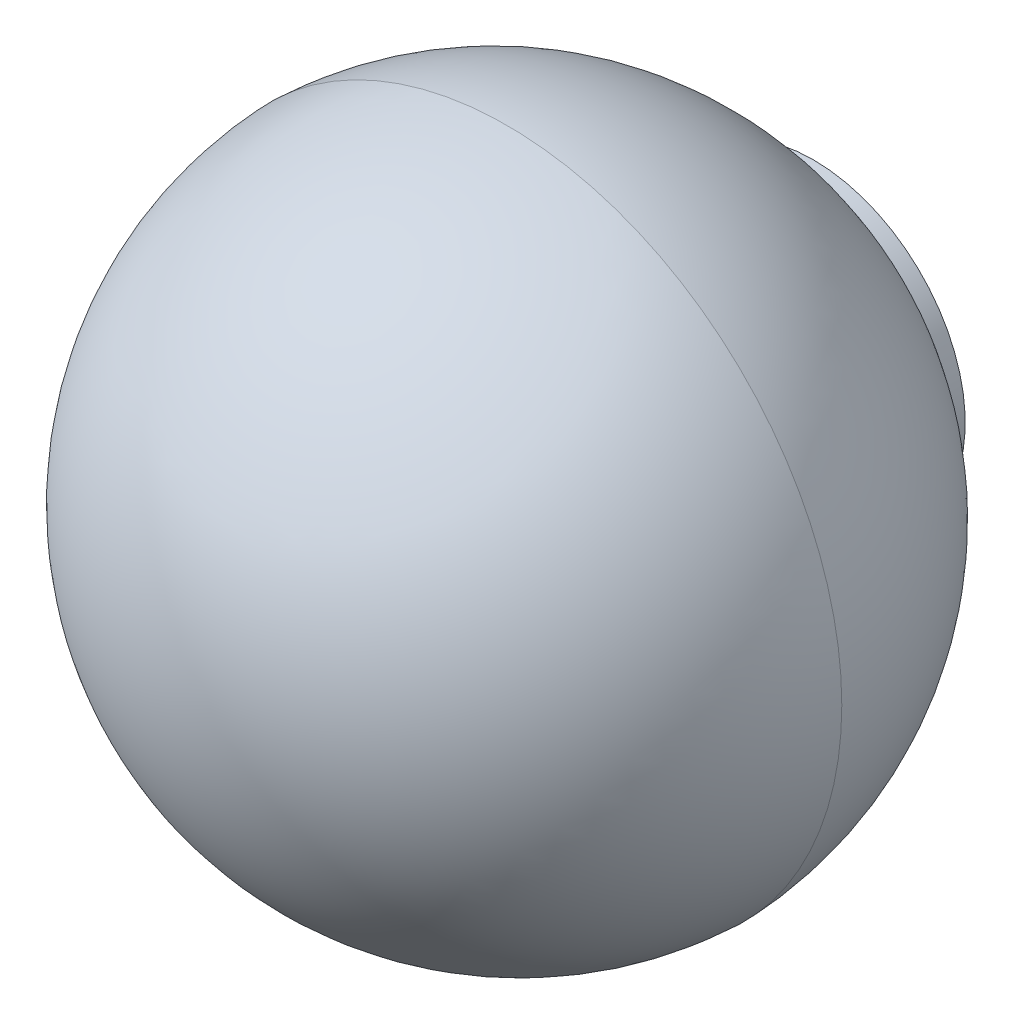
ISO-10303-21;
HEADER;
FILE_DESCRIPTION(('STEP AP214'),'2;1');
FILE_NAME('part.step','',(''),(''),'','','');
FILE_SCHEMA(('AUTOMOTIVE_DESIGN { 1 0 10303 214 1 1 1 1 }'));
ENDSEC;
DATA;
#1=APPLICATION_CONTEXT('core data for automotive mechanical design processes');
#2=APPLICATION_PROTOCOL_DEFINITION('international standard','automotive_design',2000,#1);
#3=PRODUCT_CONTEXT('',#1,'mechanical');
#4=PRODUCT('Part','Part','',(#3));
#5=PRODUCT_RELATED_PRODUCT_CATEGORY('part','',(#4));
#6=PRODUCT_DEFINITION_FORMATION('','',#4);
#7=PRODUCT_DEFINITION_CONTEXT('part definition',#1,'design');
#8=PRODUCT_DEFINITION('design','',#6,#7);
#9=PRODUCT_DEFINITION_SHAPE('','',#8);
#10=(LENGTH_UNIT() NAMED_UNIT(*) SI_UNIT(.MILLI.,.METRE.));
#11=(NAMED_UNIT(*) PLANE_ANGLE_UNIT() SI_UNIT($,.RADIAN.));
#12=(NAMED_UNIT(*) SI_UNIT($,.STERADIAN.) SOLID_ANGLE_UNIT());
#13=UNCERTAINTY_MEASURE_WITH_UNIT(LENGTH_MEASURE(1.E-05),#10,'distance_accuracy_value','');
#14=(GEOMETRIC_REPRESENTATION_CONTEXT(3) GLOBAL_UNCERTAINTY_ASSIGNED_CONTEXT((#13)) GLOBAL_UNIT_ASSIGNED_CONTEXT((#10,
#11,#12)) REPRESENTATION_CONTEXT('',''));
#15=CARTESIAN_POINT('',(0.,0.,0.));
#16=DIRECTION('',(0.,0.,1.));
#17=DIRECTION('',(1.,0.,0.));
#18=AXIS2_PLACEMENT_3D('',#15,#16,#17);
#19=CARTESIAN_POINT('',(0.,0.,14.));
#20=DIRECTION('',(0.,0.,-1.));
#21=DIRECTION('',(-1.,0.,0.));
#22=AXIS2_PLACEMENT_3D('',#19,#20,#21);
#23=SPHERICAL_SURFACE('',#22,16.);
#24=CARTESIAN_POINT('',(0.,0.,14.631575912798));
#25=DIRECTION('',(0.,0.,-1.));
#26=DIRECTION('',(0.,1.,0.));
#27=AXIS2_PLACEMENT_3D('',#24,#25,#26);
#28=CIRCLE('',#27,15.9875298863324);
#29=CARTESIAN_POINT('',(-15.9875298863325,0.,14.631575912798));
#30=VERTEX_POINT('',#29);
#31=EDGE_CURVE('E8',#30,#30,#28,.T.);
#32=ORIENTED_EDGE('',*,*,#31,.F.);
#33=EDGE_LOOP('',(#32));
#34=FACE_BOUND('',#33,.T.);
#35=ADVANCED_FACE('F12',(#34),#23,.T.);
#36=CARTESIAN_POINT('',(0.,0.,15.2631518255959));
#37=DIRECTION('',(0.,0.,-1.));
#38=DIRECTION('',(-1.,0.,0.));
#39=AXIS2_PLACEMENT_3D('',#36,#37,#38);
#40=SPHERICAL_SURFACE('',#39,16.);
#41=CARTESIAN_POINT('',(0.,0.,0.999999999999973));
#42=DIRECTION('',(0.,0.,-1.));
#43=DIRECTION('',(0.,1.,0.));
#44=AXIS2_PLACEMENT_3D('',#41,#42,#43);
#45=CIRCLE('',#44,7.25);
#46=CARTESIAN_POINT('',(-7.25000000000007,0.,0.999999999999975));
#47=VERTEX_POINT('',#46);
#48=EDGE_CURVE('E18',#47,#47,#45,.T.);
#49=CARTESIAN_POINT('',(-7.25000000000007,0.,0.999999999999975));
#50=CARTESIAN_POINT('',(-7.40764475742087,0.,1.08012997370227));
#51=CARTESIAN_POINT('',(-7.56395994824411,0.,1.16287549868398));
#52=CARTESIAN_POINT('',(-7.87376180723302,0.,1.33350223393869));
#53=CARTESIAN_POINT('',(-8.02724847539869,0.,1.4213834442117));
#54=CARTESIAN_POINT('',(-8.33122389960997,0.,1.60218613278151));
#55=CARTESIAN_POINT('',(-8.48171265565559,0.,1.69510761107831));
#56=CARTESIAN_POINT('',(-8.77952699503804,0.,1.88588836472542));
#57=CARTESIAN_POINT('',(-8.92685257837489,0.,1.98374764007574));
#58=CARTESIAN_POINT('',(-9.2181785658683,0.,2.18429649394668));
#59=CARTESIAN_POINT('',(-9.36217897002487,0.,2.28698607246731));
#60=CARTESIAN_POINT('',(-9.64669630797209,0.,2.49708262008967));
#61=CARTESIAN_POINT('',(-9.78721324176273,0.,2.60448958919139));
#62=CARTESIAN_POINT('',(-10.0646091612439,0.,2.82390284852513));
#63=CARTESIAN_POINT('',(-10.2014881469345,0.,2.93590913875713));
#64=CARTESIAN_POINT('',(-10.4714576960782,0.,3.16439790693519));
#65=CARTESIAN_POINT('',(-10.6045482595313,0.,3.28088038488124));
#66=CARTESIAN_POINT('',(-10.8667946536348,0.,3.51819347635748));
#67=CARTESIAN_POINT('',(-10.9959504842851,0.,3.63902408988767));
#68=CARTESIAN_POINT('',(-11.2501854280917,0.,3.88490061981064));
#69=CARTESIAN_POINT('',(-11.3752645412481,0.,4.00994653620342));
#70=CARTESIAN_POINT('',(-11.6212085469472,0.,4.26411620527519));
#71=CARTESIAN_POINT('',(-11.7420734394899,0.,4.39323995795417));
#72=CARTESIAN_POINT('',(-11.9794561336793,0.,4.65542335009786));
#73=CARTESIAN_POINT('',(-12.0959739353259,0.,4.78848298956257));
#74=CARTESIAN_POINT('',(-12.3245343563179,0.,5.05839187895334));
#75=CARTESIAN_POINT('',(-12.4365769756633,0.,5.1952411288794));
#76=CARTESIAN_POINT('',(-12.6560638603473,0.,5.47257879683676));
#77=CARTESIAN_POINT('',(-12.7635081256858,0.,5.61306721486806));
#78=CARTESIAN_POINT('',(-12.9736801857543,0.,5.89752877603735));
#79=CARTESIAN_POINT('',(-13.0764079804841,0.,6.04150191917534));
#80=CARTESIAN_POINT('',(-13.2770341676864,0.,6.33277465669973));
#81=CARTESIAN_POINT('',(-13.3749325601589,0.,6.48007425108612));
#82=CARTESIAN_POINT('',(-13.5657923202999,0.,6.77783796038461));
#83=CARTESIAN_POINT('',(-13.6587536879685,0.,6.92830207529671));
#84=CARTESIAN_POINT('',(-13.83963720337,0.,7.23222941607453));
#85=CARTESIAN_POINT('',(-13.9275593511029,0.,7.38569264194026));
#86=CARTESIAN_POINT('',(-14.0982677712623,0.,7.69544949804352));
#87=CARTESIAN_POINT('',(-14.1810540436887,0.,7.85174312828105));
#88=CARTESIAN_POINT('',(-14.3413997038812,0.,8.1669889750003));
#89=CARTESIAN_POINT('',(-14.4189590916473,0.,8.32594119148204));
#90=CARTESIAN_POINT('',(-14.5687657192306,0.,8.64632946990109));
#91=CARTESIAN_POINT('',(-14.6410129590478,0.,8.80776553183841));
#92=CARTESIAN_POINT('',(-14.7801158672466,0.,9.13294402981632));
#93=CARTESIAN_POINT('',(-14.8469715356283,0.,9.29668646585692));
#94=CARTESIAN_POINT('',(-14.9752178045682,0.,9.62629770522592));
#95=CARTESIAN_POINT('',(-15.0366084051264,0.,9.79216650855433));
#96=CARTESIAN_POINT('',(-15.153857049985,0.,10.1258481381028));
#97=CARTESIAN_POINT('',(-15.2097150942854,0.,10.293660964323));
#98=CARTESIAN_POINT('',(-15.3158372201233,0.,10.6310461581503));
#99=CARTESIAN_POINT('',(-15.3661013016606,0.,10.8006185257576));
#100=CARTESIAN_POINT('',(-15.4609802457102,0.,11.1413363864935));
#101=CARTESIAN_POINT('',(-15.5055951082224,0.,11.3124818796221));
#102=CARTESIAN_POINT('',(-15.5891265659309,0.,11.6561578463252));
#103=CARTESIAN_POINT('',(-15.6280431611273,0.,11.8286883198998));
#104=CARTESIAN_POINT('',(-15.7001353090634,0.,12.1749445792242));
#105=CARTESIAN_POINT('',(-15.7333108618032,0.,12.3486703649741));
#106=CARTESIAN_POINT('',(-15.7938844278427,0.,12.6971262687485));
#107=CARTESIAN_POINT('',(-15.8212824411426,0.,12.871856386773));
#108=CARTESIAN_POINT('',(-15.8702709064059,0.,13.2221288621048));
#109=CARTESIAN_POINT('',(-15.8918613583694,0.,13.3976712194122));
#110=CARTESIAN_POINT('',(-15.9292106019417,0.,13.7493752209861));
#111=CARTESIAN_POINT('',(-15.9449693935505,0.,13.9255368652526));
#112=CARTESIAN_POINT('',(-15.9706393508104,0.,14.2782856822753));
#113=CARTESIAN_POINT('',(-15.9805505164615,0.,14.4548728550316));
#114=CARTESIAN_POINT('',(-15.9875298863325,0.,14.631575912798));
#115=B_SPLINE_CURVE_WITH_KNOTS('',3,(#49,#50,#51,#52,#53,#54,#55,#56,#57,#58,#59,#60,#61,#62,
#63,#64,#65,#66,#67,#68,#69,#70,#71,#72,#73,#74,#75,#76,#77,#78,#79,#80,#81,#82,#83,#84,#85,#86,
#87,#88,#89,#90,#91,#92,#93,#94,#95,#96,#97,#98,#99,#100,#101,#102,#103,#104,#105,#106,#107,
#108,#109,#110,#111,#112,#113,#114),.UNSPECIFIED.,.F.,.F.,(4,2,2,2,2,2,2,2,2,2,2,2,2,2,2,2,2,2,
2,2,2,2,2,2,2,2,2,2,2,2,2,2,4),(0.,0.530498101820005,1.06099620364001,1.59149430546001,
2.12199240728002,2.65249050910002,3.18298861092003,3.71348671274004,4.24398481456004,
4.77448291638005,5.30498101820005,5.83547912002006,6.36597722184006,6.89647532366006,
7.42697342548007,7.95747152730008,8.48796962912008,9.01846773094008,9.54896583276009,
10.0794639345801,10.6099620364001,11.1404601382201,11.6709582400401,12.2014563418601,
12.7319544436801,13.2624525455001,13.7929506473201,14.3234487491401,14.8539468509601,
15.3844449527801,15.9149430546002,16.4454411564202,16.9759392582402),.UNSPECIFIED.);
#116=EDGE_CURVE('BSEAM51',#47,#30,#115,.T.);
#117=ORIENTED_EDGE('',*,*,#48,.F.);
#118=ORIENTED_EDGE('',*,*,#31,.T.);
#119=ORIENTED_EDGE('',*,*,#116,.T.);
#120=ORIENTED_EDGE('',*,*,#116,.F.);
#121=EDGE_LOOP('',(#117,#119,#118,#120));
#122=FACE_BOUND('',#121,.T.);
#123=ADVANCED_FACE('F51',(#122),#40,.T.);
#124=CARTESIAN_POINT('',(0.,0.,-5.));
#125=DIRECTION('',(0.,0.,-1.));
#126=DIRECTION('',(0.,1.,0.));
#127=AXIS2_PLACEMENT_3D('',#124,#125,#126);
#128=CYLINDRICAL_SURFACE('',#127,7.25);
#129=CARTESIAN_POINT('',(0.,0.,0.));
#130=DIRECTION('',(0.,0.,-1.));
#131=DIRECTION('',(0.,1.,0.));
#132=AXIS2_PLACEMENT_3D('',#129,#130,#131);
#133=CIRCLE('',#132,7.25);
#134=CARTESIAN_POINT('',(0.,7.25,0.));
#135=VERTEX_POINT('',#134);
#136=EDGE_CURVE('E22',#135,#135,#133,.T.);
#137=ORIENTED_EDGE('',*,*,#136,.F.);
#138=EDGE_LOOP('',(#137));
#139=FACE_BOUND('',#138,.T.);
#140=ORIENTED_EDGE('',*,*,#48,.T.);
#141=EDGE_LOOP('',(#140));
#142=FACE_BOUND('',#141,.T.);
#143=ADVANCED_FACE('F46',(#139,#142),#128,.T.);
#144=CARTESIAN_POINT('',(-7.25,0.,0.));
#145=DIRECTION('',(0.,0.,1.));
#146=DIRECTION('',(0.,-1.,0.));
#147=AXIS2_PLACEMENT_3D('',#144,#145,#146);
#148=PLANE('',#147);
#149=CARTESIAN_POINT('',(0.,0.,0.));
#150=DIRECTION('',(0.,0.,-1.));
#151=DIRECTION('',(0.,1.,0.));
#152=AXIS2_PLACEMENT_3D('',#149,#150,#151);
#153=CIRCLE('',#152,4.);
#154=CARTESIAN_POINT('',(0.,4.,0.));
#155=VERTEX_POINT('',#154);
#156=EDGE_CURVE('E26',#155,#155,#153,.T.);
#157=ORIENTED_EDGE('',*,*,#156,.F.);
#158=EDGE_LOOP('',(#157));
#159=FACE_BOUND('',#158,.T.);
#160=ORIENTED_EDGE('',*,*,#136,.T.);
#161=EDGE_LOOP('',(#160));
#162=FACE_BOUND('',#161,.T.);
#163=ADVANCED_FACE('F40',(#159,#162),#148,.F.);
#164=CARTESIAN_POINT('',(0.,0.,-5.));
#165=DIRECTION('',(0.,0.,-1.));
#166=DIRECTION('',(0.,1.,0.));
#167=AXIS2_PLACEMENT_3D('',#164,#165,#166);
#168=CYLINDRICAL_SURFACE('',#167,4.);
#169=CARTESIAN_POINT('',(0.,0.,14.));
#170=DIRECTION('',(0.,0.,-1.));
#171=DIRECTION('',(0.,1.,0.));
#172=AXIS2_PLACEMENT_3D('',#169,#170,#171);
#173=CIRCLE('',#172,4.);
#174=CARTESIAN_POINT('',(0.,4.,14.));
#175=VERTEX_POINT('',#174);
#176=EDGE_CURVE('E31',#175,#175,#173,.T.);
#177=ORIENTED_EDGE('',*,*,#176,.F.);
#178=EDGE_LOOP('',(#177));
#179=FACE_BOUND('',#178,.T.);
#180=ORIENTED_EDGE('',*,*,#156,.T.);
#181=EDGE_LOOP('',(#180));
#182=FACE_BOUND('',#181,.T.);
#183=ADVANCED_FACE('F37',(#179,#182),#168,.F.);
#184=CARTESIAN_POINT('',(-4.,0.,14.));
#185=DIRECTION('',(0.,0.,1.));
#186=DIRECTION('',(0.,-1.,0.));
#187=AXIS2_PLACEMENT_3D('',#184,#185,#186);
#188=PLANE('',#187);
#189=ORIENTED_EDGE('',*,*,#176,.T.);
#190=EDGE_LOOP('',(#189));
#191=FACE_BOUND('',#190,.T.);
#192=ADVANCED_FACE('F35',(#191),#188,.F.);
#193=CLOSED_SHELL('',(#35,#123,#143,#163,#183,#192));
#194=MANIFOLD_SOLID_BREP('B1',#193);
#195=ADVANCED_BREP_SHAPE_REPRESENTATION('',(#18,#194),#14);
#196=SHAPE_DEFINITION_REPRESENTATION(#9,#195);
ENDSEC;
END-ISO-10303-21;
